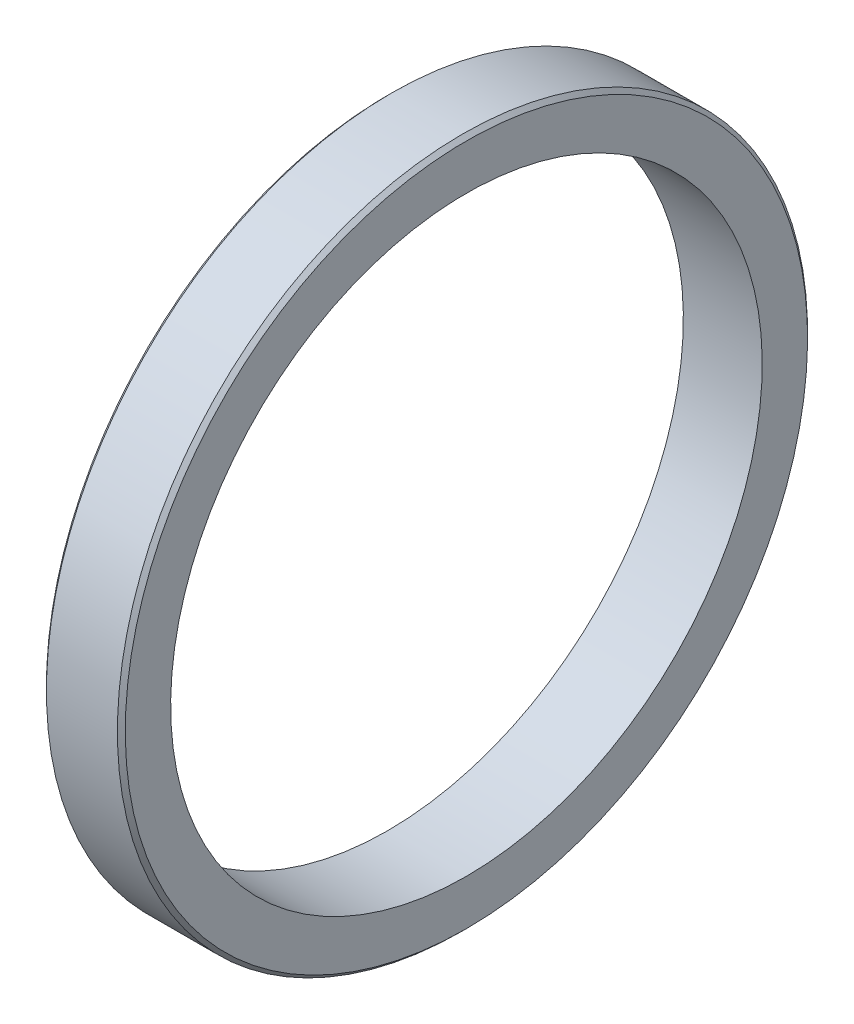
from build123d import *


with BuildPart() as part:
    # Sketch1 → Revolve1 (revolve)
    with BuildSketch(Plane.XY, mode=Mode.PRIVATE) as revolve1_sk:
        Polygon((0, 17.3), (0, 15), (4, 15), (4, 17.3), (3.8, 17.5), (0.2, 17.5), align=None)
    revolve(revolve1_sk.sketch.rotate(Axis((4, 0, 0), (-1, 0, 0)), 180), axis=Axis((4, 0, 0), (-1, 0, 0)))


solid = part.part
